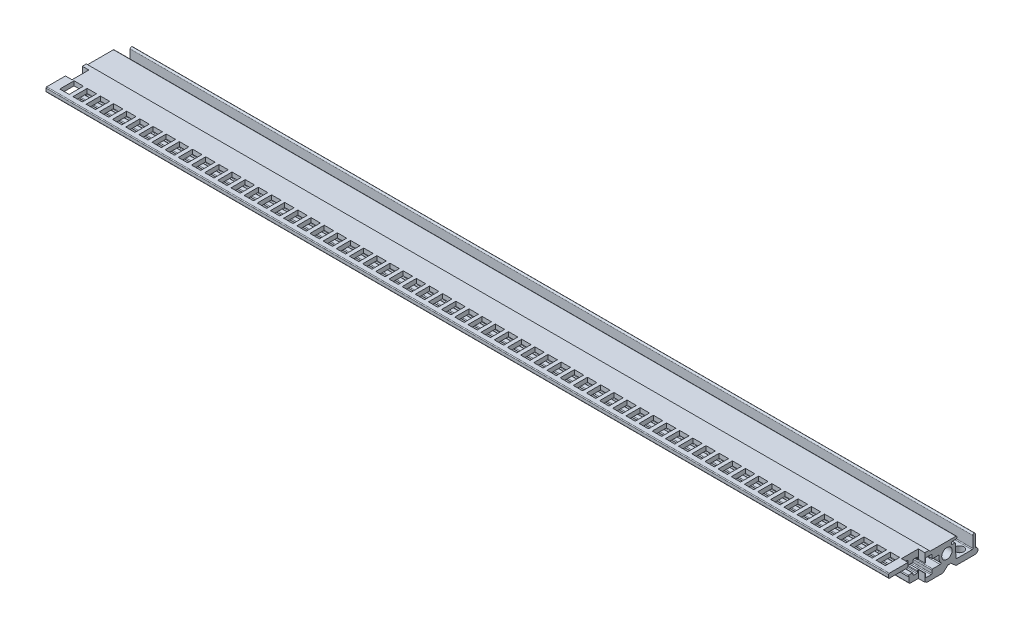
from build123d import *

# Parameters (mm, degrees)
SKETCH_1_R          = 2
EXTRUDE_1_DEPTH     = 162.56
EXTRUDE_4_DEPTH     = 325.12
EXTRUDE_3_DEPTH     = 325.12
CUT_EXTRUDE_1_REACH = 166.989
SKETCH_3_W          = 2.54
SKETCH_3_H          = 6.5
SKETCH_4_R          = 1.65
CUT_EXTRUDE_2_DEPTH = 9.8
SKETCH_5_W          = 3.6
SKETCH_5_H          = 5.5
CUT_EXTRUDE_3_DEPTH = 9.9
FILLET_1_R          = 0.3


with BuildPart() as part:
    # Sketch 1 → Extrude 1 (new, symmetric)
    with BuildSketch(Plane(origin=(0, 0, 0), x_dir=(0, 0, -1), z_dir=(1, 0, 0))):
        with BuildLine():
            Line((2.006061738, 2.145757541), (2.056061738, 2.145757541))
            ThreePointArc((2.056061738, 2.145757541), (2.197483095, 2.087178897), (2.256061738, 1.945757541))
            Line((2.256061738, 1.945757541), (2.256061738, -0.054242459))
            ThreePointArc((2.256061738, -0.054242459), (2.343929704, -0.266374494), (2.556061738, -0.354242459))
            Line((2.556061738, -0.354242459), (6.056061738, -0.354242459))
            ThreePointArc((6.056061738, -0.354242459), (6.245798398, -0.421863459), (6.350000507, -0.594242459))
            ThreePointArc((6.350000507, -0.594242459), (6.41946858, -0.709161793), (6.545959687, -0.754242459))
            Line((6.545959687, -0.754242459), (12.640079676, -0.754242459))
            ThreePointArc((12.640079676, -0.754242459), (12.748258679, -0.734059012), (12.841881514, -0.676224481))
            Line((12.841881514, -0.676224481), (14.682337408, 0.99691724))
            ThreePointArc((14.682337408, 0.99691724), (14.873755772, 1.07475547), (15.070100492, 1.010346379))
            ThreePointArc((15.070100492, 1.010346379), (15.256061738, 0.945757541), (15.442022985, 1.010346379))
            ThreePointArc((15.442022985, 1.010346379), (15.638367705, 1.07475547), (15.829786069, 0.99691724))
            Line((15.829786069, 0.99691724), (17.670241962, -0.676224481))
            ThreePointArc((17.670241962, -0.676224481), (17.763864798, -0.734059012), (17.872043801, -0.754242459))
            Line((17.872043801, -0.754242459), (25.156061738, -0.754242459))
            ThreePointArc((25.156061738, -0.754242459), (26.244537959, 0.186951), (25.470347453, 1.399903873))
            ThreePointArc((25.470347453, 1.399903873), (25.315526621, 1.508114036), (25.256061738, 1.687398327))
            Line((25.256061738, 1.687398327), (25.256061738, 6.045757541))
            ThreePointArc((25.256061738, 6.045757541), (24.756061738, 6.545757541), (24.256061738, 6.045757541))
            Line((24.256061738, 6.045757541), (24.256061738, 1.745757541))
            ThreePointArc((24.256061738, 1.745757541), (24.168193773, 1.533625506), (23.956061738, 1.445757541))
            Line((23.956061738, 1.445757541), (18.056061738, 1.445757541))
            ThreePointArc((18.056061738, 1.445757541), (17.843929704, 1.533625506), (17.756061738, 1.745757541))
            Line((17.756061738, 1.745757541), (17.756061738, 3.099347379))
            ThreePointArc((17.756061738, 3.099347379), (17.729266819, 3.199347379), (17.656061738, 3.27255246))
            ThreePointArc((17.656061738, 3.27255246), (17.582856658, 3.345757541), (17.556061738, 3.445757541))
            Line((17.556061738, 3.445757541), (17.556061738, 6.745757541))
            ThreePointArc((17.556061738, 6.745757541), (17.468193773, 6.957889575), (17.256061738, 7.045757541))
            Line((17.256061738, 7.045757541), (16.356061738, 7.045757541))
            ThreePointArc((16.356061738, 7.045757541), (16.143929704, 7.133625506), (16.056061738, 7.345757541))
            Line((16.056061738, 7.345757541), (16.056061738, 7.745757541))
            ThreePointArc((16.056061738, 7.745757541), (16.143929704, 7.957889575), (16.356061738, 8.045757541))
            Line((16.356061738, 8.045757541), (17.756061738, 8.045757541))
            ThreePointArc((17.756061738, 8.045757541), (17.968193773, 8.133625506), (18.056061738, 8.345757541))
            Line((18.056061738, 8.345757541), (18.056061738, 8.745757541))
            ThreePointArc((18.056061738, 8.745757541), (17.968193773, 8.957889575), (17.756061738, 9.045757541))
            Line((17.756061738, 9.045757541), (-7.943938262, 9.045757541))
            ThreePointArc((-7.943938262, 9.045757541), (-8.156070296, 8.957889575), (-8.243938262, 8.745757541))
            Line((-8.243938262, 8.745757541), (-8.243938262, 8.145757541))
            ThreePointArc((-8.243938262, 8.145757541), (-8.156070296, 7.933625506), (-7.943938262, 7.845757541))
            Line((-7.943938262, 7.845757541), (1.456061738, 7.845757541))
            ThreePointArc((1.456061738, 7.845757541), (1.668193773, 7.757889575), (1.756061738, 7.545757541))
            Line((1.756061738, 7.545757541), (1.756061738, 6.345757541))
            ThreePointArc((1.756061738, 6.345757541), (1.843929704, 6.133625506), (2.056061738, 6.045757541))
            Line((2.056061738, 6.045757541), (3.456061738, 6.045757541))
            ThreePointArc((3.456061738, 6.045757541), (3.668193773, 6.133625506), (3.756061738, 6.345757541))
            Line((3.756061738, 6.345757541), (3.756061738, 6.745757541))
            ThreePointArc((3.756061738, 6.745757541), (3.843929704, 6.957889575), (4.056061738, 7.045757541))
            Line((4.056061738, 7.045757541), (5.156061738, 7.045757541))
            ThreePointArc((5.156061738, 7.045757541), (5.368193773, 6.957889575), (5.456061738, 6.745757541))
            Line((5.456061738, 6.745757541), (5.456061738, 6.345757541))
            ThreePointArc((5.456061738, 6.345757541), (5.756061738, 6.045757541), (6.056061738, 6.345757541))
            Line((6.056061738, 6.345757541), (6.056061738, 7.405757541))
            ThreePointArc((6.056061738, 7.405757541), (6.143929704, 7.617889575), (6.356061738, 7.705757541))
            Line((6.356061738, 7.705757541), (8.156061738, 7.705757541))
            ThreePointArc((8.156061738, 7.705757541), (8.368193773, 7.617889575), (8.456061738, 7.405757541))
            Line((8.456061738, 7.405757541), (8.456061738, 6.345757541))
            ThreePointArc((8.456061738, 6.345757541), (8.543929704, 6.133625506), (8.756061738, 6.045757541))
            Line((8.756061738, 6.045757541), (10.980012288, 6.045757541))
            ThreePointArc((10.980012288, 6.045757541), (11.213256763, 5.934429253), (11.273389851, 5.683070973))
            ThreePointArc((11.273389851, 5.683070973), (11.28883719, 4.340010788), (11.879723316, 3.133817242))
            ThreePointArc((11.879723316, 3.133817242), (11.916556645, 2.816177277), (11.645985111, 2.645757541))
            Line((11.645985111, 2.645757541), (8.756061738, 2.645757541))
            ThreePointArc((8.756061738, 2.645757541), (8.543929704, 2.557889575), (8.456061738, 2.345757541))
            Line((8.456061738, 2.345757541), (8.456061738, 1.285757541))
            ThreePointArc((8.456061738, 1.285757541), (8.368193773, 1.073625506), (8.156061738, 0.985757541))
            Line((8.156061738, 0.985757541), (6.356061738, 0.985757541))
            ThreePointArc((6.356061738, 0.985757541), (6.143929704, 1.073625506), (6.056061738, 1.285757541))
            Line((6.056061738, 1.285757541), (6.056061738, 2.345757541))
            ThreePointArc((6.056061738, 2.345757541), (5.756061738, 2.645757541), (5.456061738, 2.345757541))
            Line((5.456061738, 2.345757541), (5.456061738, 1.945757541))
            ThreePointArc((5.456061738, 1.945757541), (5.368193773, 1.733625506), (5.156061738, 1.645757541))
            Line((5.156061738, 1.645757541), (4.056061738, 1.645757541))
            ThreePointArc((4.056061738, 1.645757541), (3.843929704, 1.733625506), (3.756061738, 1.945757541))
            Line((3.756061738, 1.945757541), (3.756061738, 2.345757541))
            ThreePointArc((3.756061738, 2.345757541), (3.668193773, 2.557889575), (3.456061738, 2.645757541))
            Line((3.456061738, 2.645757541), (2.006061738, 2.645757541))
            ThreePointArc((2.006061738, 2.645757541), (1.756061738, 2.395757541), (2.006061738, 2.145757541))
        make_face()
        with Locations((14.256061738, 5.045757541)):
            Circle(SKETCH_1_R, mode=Mode.SUBTRACT)
    extrude(amount=EXTRUDE_1_DEPTH, both=True)

    # Sketch 7 → Extrude 4 (add, through all)
    with BuildSketch(Plane(origin=(162.56, 0, 0), x_dir=(0, 0, -1), z_dir=(1, 0, 0))):
        with BuildLine():
            Line((-7.943938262, 9.045757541), (-8.243938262, 9.045757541))
            Line((-8.243938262, 9.045757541), (-8.243938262, 8.745757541))
            ThreePointArc((-8.243938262, 8.745757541), (-8.156070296, 8.957889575), (-7.943938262, 9.045757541))
        make_face()
    extrude(amount=-EXTRUDE_4_DEPTH)

    # Sketch 6 → Extrude 3 (add, through all)
    with BuildSketch(Plane.ZY.offset(162.56)):
        Polygon((-7.806061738, 9.045757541), (8.243938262, 9.045757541), (8.243938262, 9.545757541), (-7.306061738, 9.545757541), align=None)
    extrude(amount=-EXTRUDE_3_DEPTH)

    # Cut-Extrude 1: up to this face of the body (flat: up to its plane)
    cut_extrude_1_end = Plane(part.part.faces().sort_by_distance((0, -0.754242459, -9.593019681))[0])
    # Sketch 3 → Cut-Extrude 1 (cut, up to the picked face)
    with BuildSketch(Plane(origin=(0, 9.545757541, 0), x_dir=(1, 0, 0), z_dir=(0, 1, 0)), mode=Mode.PRIVATE) as cut_extrude_1_sk1:
        with Locations((161.29, 2.506061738)):
            Rectangle(SKETCH_3_W, SKETCH_3_H)
    cut_extrude_1_tool1 = split(extrude(cut_extrude_1_sk1.sketch, amount=-CUT_EXTRUDE_1_REACH, mode=Mode.PRIVATE), bisect_by=cut_extrude_1_end, keep=Keep.BOTH, mode=Mode.PRIVATE)
    # Sketch 3 → Cut-Extrude 1 (cut, up to the picked face)
    with BuildSketch(Plane(origin=(0, 9.545757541, 0), x_dir=(1, 0, 0), z_dir=(0, 1, 0)), mode=Mode.PRIVATE) as cut_extrude_1_sk2:
        with Locations((-161.29, 2.506061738)):
            Rectangle(SKETCH_3_W, SKETCH_3_H)
    cut_extrude_1_tool2 = split(extrude(cut_extrude_1_sk2.sketch, amount=-CUT_EXTRUDE_1_REACH, mode=Mode.PRIVATE), bisect_by=cut_extrude_1_end, keep=Keep.BOTH, mode=Mode.PRIVATE)
    add(cut_extrude_1_tool1.solids().sort_by(Axis((161.29, 9.545758, -2.506062), (0, -1, 0)))[0], mode=Mode.SUBTRACT)
    add(cut_extrude_1_tool2.solids().sort_by(Axis((-161.29, 9.545758, -2.506062), (0, -1, 0)))[0], mode=Mode.SUBTRACT)

    # Sketch 4 → Cut-Extrude 2 (cut)
    with BuildSketch(Plane(origin=(0, -0.754242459, 0), x_dir=(-1, 0, 0), z_dir=(0, -1, 0))):
        with Locations(Location((-160.02, 21.706061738, 0), (0, 0, 90))):
            Circle(SKETCH_4_R)
        with Locations(Location((-154.94, 21.706061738, 0), (0, 0, 90))):
            Circle(SKETCH_4_R)
        with Locations(Location((-149.86, 21.706061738, 0), (0, 0, 90))):
            Circle(SKETCH_4_R)
        with Locations(Location((-144.78, 21.706061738, 0), (0, 0, 90))):
            Circle(SKETCH_4_R)
        with Locations(Location((-139.7, 21.706061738, 0), (0, 0, 90))):
            Circle(SKETCH_4_R)
        with Locations(Location((-134.62, 21.706061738, 0), (0, 0, 90))):
            Circle(SKETCH_4_R)
        with Locations(Location((-129.54, 21.706061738, 0), (0, 0, 90))):
            Circle(SKETCH_4_R)
        with Locations(Location((-124.46, 21.706061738, 0), (0, 0, 90))):
            Circle(SKETCH_4_R)
        with Locations(Location((-119.38, 21.706061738, 0), (0, 0, 90))):
            Circle(SKETCH_4_R)
        with Locations(Location((-114.3, 21.706061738, 0), (0, 0, 90))):
            Circle(SKETCH_4_R)
        with Locations(Location((-109.22, 21.706061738, 0), (0, 0, 90))):
            Circle(SKETCH_4_R)
        with Locations(Location((-104.14, 21.706061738, 0), (0, 0, 90))):
            Circle(SKETCH_4_R)
        with Locations(Location((-99.06, 21.706061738, 0), (0, 0, 90))):
            Circle(SKETCH_4_R)
        with Locations(Location((-93.98, 21.706061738, 0), (0, 0, 90))):
            Circle(SKETCH_4_R)
        with Locations(Location((-88.9, 21.706061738, 0), (0, 0, 90))):
            Circle(SKETCH_4_R)
        with Locations(Location((-83.82, 21.706061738, 0), (0, 0, 90))):
            Circle(SKETCH_4_R)
        with Locations(Location((-78.74, 21.706061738, 0), (0, 0, 90))):
            Circle(SKETCH_4_R)
        with Locations(Location((-73.66, 21.706061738, 0), (0, 0, 90))):
            Circle(SKETCH_4_R)
        with Locations(Location((-68.58, 21.706061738, 0), (0, 0, 90))):
            Circle(SKETCH_4_R)
        with Locations(Location((-63.5, 21.706061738, 0), (0, 0, 90))):
            Circle(SKETCH_4_R)
        with Locations(Location((-58.42, 21.706061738, 0), (0, 0, 90))):
            Circle(SKETCH_4_R)
        with Locations(Location((-53.34, 21.706061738, 0), (0, 0, 90))):
            Circle(SKETCH_4_R)
        with Locations(Location((-48.26, 21.706061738, 0), (0, 0, 90))):
            Circle(SKETCH_4_R)
        with Locations(Location((-43.18, 21.706061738, 0), (0, 0, 90))):
            Circle(SKETCH_4_R)
        with Locations(Location((-38.1, 21.706061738, 0), (0, 0, 90))):
            Circle(SKETCH_4_R)
        with Locations(Location((-33.02, 21.706061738, 0), (0, 0, 90))):
            Circle(SKETCH_4_R)
        with Locations(Location((-27.94, 21.706061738, 0), (0, 0, 90))):
            Circle(SKETCH_4_R)
        with Locations(Location((-22.86, 21.706061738, 0), (0, 0, 90))):
            Circle(SKETCH_4_R)
        with Locations(Location((-17.78, 21.706061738, 0), (0, 0, 90))):
            Circle(SKETCH_4_R)
        with Locations(Location((-12.7, 21.706061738, 0), (0, 0, 90))):
            Circle(SKETCH_4_R)
        with Locations(Location((-7.62, 21.706061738, 0), (0, 0, 90))):
            Circle(SKETCH_4_R)
        with Locations(Location((-2.54, 21.706061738, 0), (0, 0, 90))):
            Circle(SKETCH_4_R)
        with Locations(Location((2.54, 21.706061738, 0), (0, 0, 90))):
            Circle(SKETCH_4_R)
        with Locations(Location((7.62, 21.706061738, 0), (0, 0, 90))):
            Circle(SKETCH_4_R)
        with Locations(Location((12.7, 21.706061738, 0), (0, 0, 90))):
            Circle(SKETCH_4_R)
        with Locations(Location((17.78, 21.706061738, 0), (0, 0, 90))):
            Circle(SKETCH_4_R)
        with Locations(Location((22.86, 21.706061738, 0), (0, 0, 90))):
            Circle(SKETCH_4_R)
        with Locations(Location((27.94, 21.706061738, 0), (0, 0, 90))):
            Circle(SKETCH_4_R)
        with Locations(Location((33.02, 21.706061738, 0), (0, 0, 90))):
            Circle(SKETCH_4_R)
        with Locations(Location((38.1, 21.706061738, 0), (0, 0, 90))):
            Circle(SKETCH_4_R)
        with Locations(Location((43.18, 21.706061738, 0), (0, 0, 90))):
            Circle(SKETCH_4_R)
        with Locations(Location((48.26, 21.706061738, 0), (0, 0, 90))):
            Circle(SKETCH_4_R)
        with Locations(Location((53.34, 21.706061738, 0), (0, 0, 90))):
            Circle(SKETCH_4_R)
        with Locations(Location((58.42, 21.706061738, 0), (0, 0, 90))):
            Circle(SKETCH_4_R)
        with Locations(Location((63.5, 21.706061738, 0), (0, 0, 90))):
            Circle(SKETCH_4_R)
        with Locations(Location((68.58, 21.706061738, 0), (0, 0, 90))):
            Circle(SKETCH_4_R)
        with Locations(Location((73.66, 21.706061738, 0), (0, 0, 90))):
            Circle(SKETCH_4_R)
        with Locations(Location((78.74, 21.706061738, 0), (0, 0, 90))):
            Circle(SKETCH_4_R)
        with Locations(Location((83.82, 21.706061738, 0), (0, 0, 90))):
            Circle(SKETCH_4_R)
        with Locations(Location((88.9, 21.706061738, 0), (0, 0, 90))):
            Circle(SKETCH_4_R)
        with Locations(Location((93.98, 21.706061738, 0), (0, 0, 90))):
            Circle(SKETCH_4_R)
        with Locations(Location((99.06, 21.706061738, 0), (0, 0, 90))):
            Circle(SKETCH_4_R)
        with Locations(Location((104.14, 21.706061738, 0), (0, 0, 90))):
            Circle(SKETCH_4_R)
        with Locations(Location((109.22, 21.706061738, 0), (0, 0, 90))):
            Circle(SKETCH_4_R)
        with Locations(Location((114.3, 21.706061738, 0), (0, 0, 90))):
            Circle(SKETCH_4_R)
        with Locations(Location((119.38, 21.706061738, 0), (0, 0, 90))):
            Circle(SKETCH_4_R)
        with Locations(Location((124.46, 21.706061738, 0), (0, 0, 90))):
            Circle(SKETCH_4_R)
        with Locations(Location((129.54, 21.706061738, 0), (0, 0, 90))):
            Circle(SKETCH_4_R)
        with Locations(Location((134.62, 21.706061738, 0), (0, 0, 90))):
            Circle(SKETCH_4_R)
        with Locations(Location((139.7, 21.706061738, 0), (0, 0, 90))):
            Circle(SKETCH_4_R)
        with Locations(Location((144.78, 21.706061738, 0), (0, 0, 90))):
            Circle(SKETCH_4_R)
        with Locations(Location((149.86, 21.706061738, 0), (0, 0, 90))):
            Circle(SKETCH_4_R)
        with Locations(Location((154.94, 21.706061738, 0), (0, 0, 90))):
            Circle(SKETCH_4_R)
        with Locations(Location((160.02, 21.706061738, 0), (0, 0, 90))):
            Circle(SKETCH_4_R)
    extrude(amount=-CUT_EXTRUDE_2_DEPTH, mode=Mode.SUBTRACT)

    # Sketch 5 → Cut-Extrude 3 (cut)
    with BuildSketch(Plane(origin=(0, 9.545757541, 0), x_dir=(1, 0, 0), z_dir=(0, 1, 0))):
        with Locations((-157.48, -3.443938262)):
            Rectangle(SKETCH_5_W, SKETCH_5_H)
        with Locations((-152.4, -3.443938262)):
            Rectangle(SKETCH_5_W, SKETCH_5_H)
        with Locations((-147.32, -3.443938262)):
            Rectangle(SKETCH_5_W, SKETCH_5_H)
        with Locations((-142.24, -3.443938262)):
            Rectangle(SKETCH_5_W, SKETCH_5_H)
        with Locations((-137.16, -3.443938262)):
            Rectangle(SKETCH_5_W, SKETCH_5_H)
        with Locations((-132.08, -3.443938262)):
            Rectangle(SKETCH_5_W, SKETCH_5_H)
        with Locations((-127, -3.443938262)):
            Rectangle(SKETCH_5_W, SKETCH_5_H)
        with Locations((-121.92, -3.443938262)):
            Rectangle(SKETCH_5_W, SKETCH_5_H)
        with Locations((-116.84, -3.443938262)):
            Rectangle(SKETCH_5_W, SKETCH_5_H)
        with Locations((-111.76, -3.443938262)):
            Rectangle(SKETCH_5_W, SKETCH_5_H)
        with Locations((-106.68, -3.443938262)):
            Rectangle(SKETCH_5_W, SKETCH_5_H)
        with Locations((-101.6, -3.443938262)):
            Rectangle(SKETCH_5_W, SKETCH_5_H)
        with Locations((-96.52, -3.443938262)):
            Rectangle(SKETCH_5_W, SKETCH_5_H)
        with Locations((-91.44, -3.443938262)):
            Rectangle(SKETCH_5_W, SKETCH_5_H)
        with Locations((-86.36, -3.443938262)):
            Rectangle(SKETCH_5_W, SKETCH_5_H)
        with Locations((-81.28, -3.443938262)):
            Rectangle(SKETCH_5_W, SKETCH_5_H)
        with Locations((-76.2, -3.443938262)):
            Rectangle(SKETCH_5_W, SKETCH_5_H)
        with Locations((-71.12, -3.443938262)):
            Rectangle(SKETCH_5_W, SKETCH_5_H)
        with Locations((-66.04, -3.443938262)):
            Rectangle(SKETCH_5_W, SKETCH_5_H)
        with Locations((-60.96, -3.443938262)):
            Rectangle(SKETCH_5_W, SKETCH_5_H)
        with Locations((-55.88, -3.443938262)):
            Rectangle(SKETCH_5_W, SKETCH_5_H)
        with Locations((-50.8, -3.443938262)):
            Rectangle(SKETCH_5_W, SKETCH_5_H)
        with Locations((-45.72, -3.443938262)):
            Rectangle(SKETCH_5_W, SKETCH_5_H)
        with Locations((-40.64, -3.443938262)):
            Rectangle(SKETCH_5_W, SKETCH_5_H)
        with Locations((-35.56, -3.443938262)):
            Rectangle(SKETCH_5_W, SKETCH_5_H)
        with Locations((-30.48, -3.443938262)):
            Rectangle(SKETCH_5_W, SKETCH_5_H)
        with Locations((-25.4, -3.443938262)):
            Rectangle(SKETCH_5_W, SKETCH_5_H)
        with Locations((-20.32, -3.443938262)):
            Rectangle(SKETCH_5_W, SKETCH_5_H)
        with Locations((-15.24, -3.443938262)):
            Rectangle(SKETCH_5_W, SKETCH_5_H)
        with Locations((-10.16, -3.443938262)):
            Rectangle(SKETCH_5_W, SKETCH_5_H)
        with Locations((-5.08, -3.443938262)):
            Rectangle(SKETCH_5_W, SKETCH_5_H)
        with Locations((0, -3.443938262)):
            Rectangle(SKETCH_5_W, SKETCH_5_H)
        with Locations((5.08, -3.443938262)):
            Rectangle(SKETCH_5_W, SKETCH_5_H)
        with Locations((10.16, -3.443938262)):
            Rectangle(SKETCH_5_W, SKETCH_5_H)
        with Locations((15.24, -3.443938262)):
            Rectangle(SKETCH_5_W, SKETCH_5_H)
        with Locations((20.32, -3.443938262)):
            Rectangle(SKETCH_5_W, SKETCH_5_H)
        with Locations((25.4, -3.443938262)):
            Rectangle(SKETCH_5_W, SKETCH_5_H)
        with Locations((30.48, -3.443938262)):
            Rectangle(SKETCH_5_W, SKETCH_5_H)
        with Locations((35.56, -3.443938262)):
            Rectangle(SKETCH_5_W, SKETCH_5_H)
        with Locations((40.64, -3.443938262)):
            Rectangle(SKETCH_5_W, SKETCH_5_H)
        with Locations((45.72, -3.443938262)):
            Rectangle(SKETCH_5_W, SKETCH_5_H)
        with Locations((50.8, -3.443938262)):
            Rectangle(SKETCH_5_W, SKETCH_5_H)
        with Locations((55.88, -3.443938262)):
            Rectangle(SKETCH_5_W, SKETCH_5_H)
        with Locations((60.96, -3.443938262)):
            Rectangle(SKETCH_5_W, SKETCH_5_H)
        with Locations((66.04, -3.443938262)):
            Rectangle(SKETCH_5_W, SKETCH_5_H)
        with Locations((71.12, -3.443938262)):
            Rectangle(SKETCH_5_W, SKETCH_5_H)
        with Locations((76.2, -3.443938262)):
            Rectangle(SKETCH_5_W, SKETCH_5_H)
        with Locations((81.28, -3.443938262)):
            Rectangle(SKETCH_5_W, SKETCH_5_H)
        with Locations((86.36, -3.443938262)):
            Rectangle(SKETCH_5_W, SKETCH_5_H)
        with Locations((91.44, -3.443938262)):
            Rectangle(SKETCH_5_W, SKETCH_5_H)
        with Locations((96.52, -3.443938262)):
            Rectangle(SKETCH_5_W, SKETCH_5_H)
        with Locations((101.6, -3.443938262)):
            Rectangle(SKETCH_5_W, SKETCH_5_H)
        with Locations((106.68, -3.443938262)):
            Rectangle(SKETCH_5_W, SKETCH_5_H)
        with Locations((111.76, -3.443938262)):
            Rectangle(SKETCH_5_W, SKETCH_5_H)
        with Locations((116.84, -3.443938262)):
            Rectangle(SKETCH_5_W, SKETCH_5_H)
        with Locations((121.92, -3.443938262)):
            Rectangle(SKETCH_5_W, SKETCH_5_H)
        with Locations((127, -3.443938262)):
            Rectangle(SKETCH_5_W, SKETCH_5_H)
        with Locations((132.08, -3.443938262)):
            Rectangle(SKETCH_5_W, SKETCH_5_H)
        with Locations((137.16, -3.443938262)):
            Rectangle(SKETCH_5_W, SKETCH_5_H)
        with Locations((142.24, -3.443938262)):
            Rectangle(SKETCH_5_W, SKETCH_5_H)
        with Locations((147.32, -3.443938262)):
            Rectangle(SKETCH_5_W, SKETCH_5_H)
        with Locations((152.4, -3.443938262)):
            Rectangle(SKETCH_5_W, SKETCH_5_H)
        with Locations((157.48, -3.443938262)):
            Rectangle(SKETCH_5_W, SKETCH_5_H)
    extrude(amount=-CUT_EXTRUDE_3_DEPTH, mode=Mode.SUBTRACT)

    # Fillet 1
    fillet_1_edges = [part.edges().sort_by_distance(p)[0] for p in [
        (0, 9.545757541, 8.243938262),
    ]]
    fillet(fillet_1_edges, radius=FILLET_1_R)


solid = part.part
